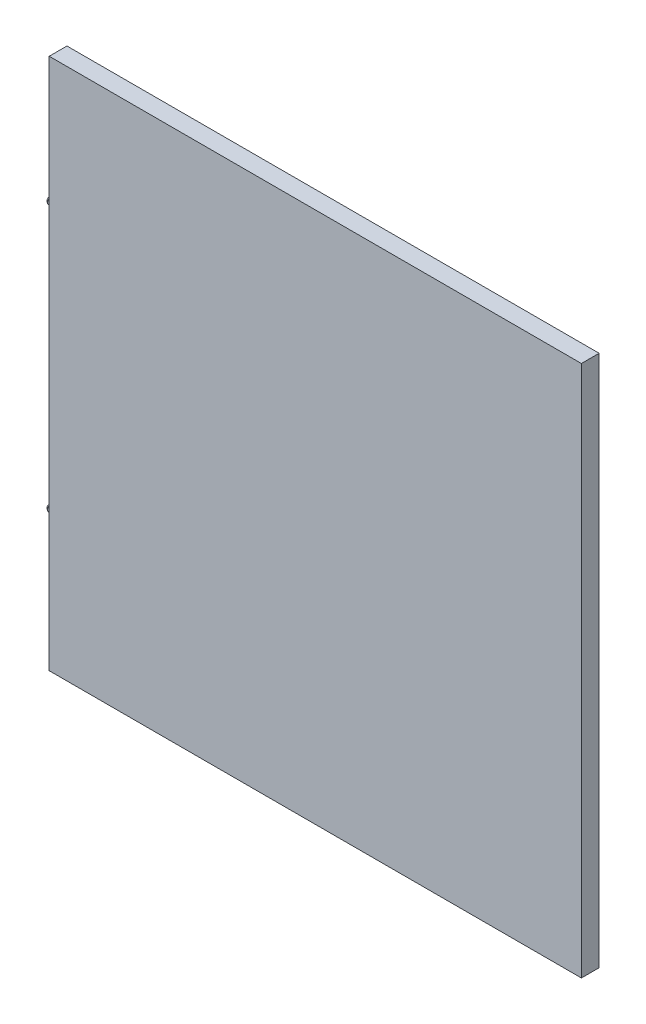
ISO-10303-21;
HEADER;
FILE_DESCRIPTION(('STEP AP214'),'2;1');
FILE_NAME('part.step','',(''),(''),'','','');
FILE_SCHEMA(('AUTOMOTIVE_DESIGN { 1 0 10303 214 1 1 1 1 }'));
ENDSEC;
DATA;
#1=APPLICATION_CONTEXT('core data for automotive mechanical design processes');
#2=APPLICATION_PROTOCOL_DEFINITION('international standard','automotive_design',2000,#1);
#3=PRODUCT_CONTEXT('',#1,'mechanical');
#4=PRODUCT('Part','Part','',(#3));
#5=PRODUCT_RELATED_PRODUCT_CATEGORY('part','',(#4));
#6=PRODUCT_DEFINITION_FORMATION('','',#4);
#7=PRODUCT_DEFINITION_CONTEXT('part definition',#1,'design');
#8=PRODUCT_DEFINITION('design','',#6,#7);
#9=PRODUCT_DEFINITION_SHAPE('','',#8);
#10=(LENGTH_UNIT() NAMED_UNIT(*) SI_UNIT(.MILLI.,.METRE.));
#11=(NAMED_UNIT(*) PLANE_ANGLE_UNIT() SI_UNIT($,.RADIAN.));
#12=(NAMED_UNIT(*) SI_UNIT($,.STERADIAN.) SOLID_ANGLE_UNIT());
#13=UNCERTAINTY_MEASURE_WITH_UNIT(LENGTH_MEASURE(1.E-05),#10,'distance_accuracy_value','');
#14=(GEOMETRIC_REPRESENTATION_CONTEXT(3) GLOBAL_UNCERTAINTY_ASSIGNED_CONTEXT((#13)) GLOBAL_UNIT_ASSIGNED_CONTEXT((#10,
#11,#12)) REPRESENTATION_CONTEXT('',''));
#15=CARTESIAN_POINT('',(0.,0.,0.));
#16=DIRECTION('',(0.,0.,1.));
#17=DIRECTION('',(1.,0.,0.));
#18=AXIS2_PLACEMENT_3D('',#15,#16,#17);
#19=CARTESIAN_POINT('',(-150.,-150.,10.));
#20=DIRECTION('',(1.,0.,0.));
#21=DIRECTION('',(0.,0.,-1.));
#22=AXIS2_PLACEMENT_3D('',#19,#20,#21);
#23=PLANE('',#22);
#24=CARTESIAN_POINT('',(-150.,75.,5.00000000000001));
#25=DIRECTION('',(1.,0.,0.));
#26=DIRECTION('',(0.,0.,-1.));
#27=AXIS2_PLACEMENT_3D('',#24,#25,#26);
#28=CIRCLE('',#27,2.);
#29=CARTESIAN_POINT('',(-150.,75.,3.00000000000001));
#30=VERTEX_POINT('',#29);
#31=EDGE_CURVE('E108',#30,#30,#28,.F.);
#32=ORIENTED_EDGE('',*,*,#31,.F.);
#33=EDGE_LOOP('',(#32));
#34=FACE_BOUND('',#33,.T.);
#35=DIRECTION('',(0.,-1.,0.));
#36=VECTOR('',#35,1.);
#37=CARTESIAN_POINT('',(-150.,-150.,0.));
#38=LINE('',#37,#36);
#39=CARTESIAN_POINT('',(-150.,150.,0.));
#40=VERTEX_POINT('',#39);
#41=CARTESIAN_POINT('',(-150.,-150.,0.));
#42=VERTEX_POINT('',#41);
#43=EDGE_CURVE('E64',#40,#42,#38,.T.);
#44=ORIENTED_EDGE('',*,*,#43,.T.);
#45=DIRECTION('',(0.,0.,-1.));
#46=VECTOR('',#45,1.);
#47=CARTESIAN_POINT('',(-150.,-150.,10.));
#48=LINE('',#47,#46);
#49=CARTESIAN_POINT('',(-150.,-150.,10.));
#50=VERTEX_POINT('',#49);
#51=EDGE_CURVE('E90',#50,#42,#48,.T.);
#52=ORIENTED_EDGE('',*,*,#51,.F.);
#53=DIRECTION('',(0.,-1.,0.));
#54=VECTOR('',#53,1.);
#55=CARTESIAN_POINT('',(-150.,-150.,10.));
#56=LINE('',#55,#54);
#57=CARTESIAN_POINT('',(-150.,150.,10.));
#58=VERTEX_POINT('',#57);
#59=EDGE_CURVE('E81',#58,#50,#56,.T.);
#60=ORIENTED_EDGE('',*,*,#59,.F.);
#61=DIRECTION('',(0.,0.,-1.));
#62=VECTOR('',#61,1.);
#63=CARTESIAN_POINT('',(-150.,150.,10.));
#64=LINE('',#63,#62);
#65=EDGE_CURVE('E86',#58,#40,#64,.T.);
#66=ORIENTED_EDGE('',*,*,#65,.T.);
#67=EDGE_LOOP('',(#44,#52,#60,#66));
#68=FACE_BOUND('',#67,.T.);
#69=CARTESIAN_POINT('',(-150.,-75.,5.00000000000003));
#70=DIRECTION('',(1.,0.,0.));
#71=DIRECTION('',(0.,0.,-1.));
#72=AXIS2_PLACEMENT_3D('',#69,#70,#71);
#73=CIRCLE('',#72,2.);
#74=CARTESIAN_POINT('',(-150.,-75.,3.00000000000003));
#75=VERTEX_POINT('',#74);
#76=EDGE_CURVE('E111',#75,#75,#73,.F.);
#77=ORIENTED_EDGE('',*,*,#76,.F.);
#78=EDGE_LOOP('',(#77));
#79=FACE_BOUND('',#78,.T.);
#80=ADVANCED_FACE('F30',(#34,#68,#79),#23,.F.);
#81=CARTESIAN_POINT('',(150.,-150.,10.));
#82=DIRECTION('',(-1.,0.,0.));
#83=DIRECTION('',(0.,0.,1.));
#84=AXIS2_PLACEMENT_3D('',#81,#82,#83);
#85=PLANE('',#84);
#86=DIRECTION('',(0.,1.,0.));
#87=VECTOR('',#86,1.);
#88=CARTESIAN_POINT('',(150.,-150.,0.));
#89=LINE('',#88,#87);
#90=CARTESIAN_POINT('',(150.,-150.,0.));
#91=VERTEX_POINT('',#90);
#92=CARTESIAN_POINT('',(150.,150.,0.));
#93=VERTEX_POINT('',#92);
#94=EDGE_CURVE('E98',#91,#93,#89,.T.);
#95=ORIENTED_EDGE('',*,*,#94,.T.);
#96=DIRECTION('',(0.,0.,-1.));
#97=VECTOR('',#96,1.);
#98=CARTESIAN_POINT('',(150.,150.,10.));
#99=LINE('',#98,#97);
#100=CARTESIAN_POINT('',(150.,150.,10.));
#101=VERTEX_POINT('',#100);
#102=EDGE_CURVE('E89',#101,#93,#99,.T.);
#103=ORIENTED_EDGE('',*,*,#102,.F.);
#104=DIRECTION('',(0.,1.,0.));
#105=VECTOR('',#104,1.);
#106=CARTESIAN_POINT('',(150.,-150.,10.));
#107=LINE('',#106,#105);
#108=CARTESIAN_POINT('',(150.,-150.,10.));
#109=VERTEX_POINT('',#108);
#110=EDGE_CURVE('E83',#109,#101,#107,.T.);
#111=ORIENTED_EDGE('',*,*,#110,.F.);
#112=DIRECTION('',(0.,0.,-1.));
#113=VECTOR('',#112,1.);
#114=CARTESIAN_POINT('',(150.,-150.,10.));
#115=LINE('',#114,#113);
#116=EDGE_CURVE('E94',#109,#91,#115,.T.);
#117=ORIENTED_EDGE('',*,*,#116,.T.);
#118=EDGE_LOOP('',(#95,#103,#111,#117));
#119=FACE_BOUND('',#118,.T.);
#120=ADVANCED_FACE('F134',(#119),#85,.F.);
#121=CARTESIAN_POINT('',(-150.,150.,10.));
#122=DIRECTION('',(0.,-1.,0.));
#123=DIRECTION('',(0.,0.,-1.));
#124=AXIS2_PLACEMENT_3D('',#121,#122,#123);
#125=PLANE('',#124);
#126=DIRECTION('',(-1.,0.,0.));
#127=VECTOR('',#126,1.);
#128=CARTESIAN_POINT('',(-150.,150.,0.));
#129=LINE('',#128,#127);
#130=EDGE_CURVE('E88',#93,#40,#129,.T.);
#131=ORIENTED_EDGE('',*,*,#130,.T.);
#132=ORIENTED_EDGE('',*,*,#65,.F.);
#133=DIRECTION('',(-1.,0.,0.));
#134=VECTOR('',#133,1.);
#135=CARTESIAN_POINT('',(-150.,150.,10.));
#136=LINE('',#135,#134);
#137=EDGE_CURVE('E78',#101,#58,#136,.T.);
#138=ORIENTED_EDGE('',*,*,#137,.F.);
#139=ORIENTED_EDGE('',*,*,#102,.T.);
#140=EDGE_LOOP('',(#131,#132,#138,#139));
#141=FACE_BOUND('',#140,.T.);
#142=ADVANCED_FACE('F87',(#141),#125,.F.);
#143=CARTESIAN_POINT('',(-150.,-150.,10.));
#144=DIRECTION('',(0.,1.,0.));
#145=DIRECTION('',(0.,0.,1.));
#146=AXIS2_PLACEMENT_3D('',#143,#144,#145);
#147=PLANE('',#146);
#148=DIRECTION('',(1.,0.,0.));
#149=VECTOR('',#148,1.);
#150=CARTESIAN_POINT('',(-150.,-150.,0.));
#151=LINE('',#150,#149);
#152=EDGE_CURVE('E70',#42,#91,#151,.T.);
#153=ORIENTED_EDGE('',*,*,#152,.T.);
#154=ORIENTED_EDGE('',*,*,#116,.F.);
#155=DIRECTION('',(1.,0.,0.));
#156=VECTOR('',#155,1.);
#157=CARTESIAN_POINT('',(-150.,-150.,10.));
#158=LINE('',#157,#156);
#159=EDGE_CURVE('E47',#50,#109,#158,.T.);
#160=ORIENTED_EDGE('',*,*,#159,.F.);
#161=ORIENTED_EDGE('',*,*,#51,.T.);
#162=EDGE_LOOP('',(#153,#154,#160,#161));
#163=FACE_BOUND('',#162,.T.);
#164=ADVANCED_FACE('F145',(#163),#147,.F.);
#165=CARTESIAN_POINT('',(150.,150.,10.));
#166=DIRECTION('',(0.,0.,-1.));
#167=DIRECTION('',(-1.,0.,0.));
#168=AXIS2_PLACEMENT_3D('',#165,#166,#167);
#169=PLANE('',#168);
#170=ORIENTED_EDGE('',*,*,#110,.T.);
#171=ORIENTED_EDGE('',*,*,#137,.T.);
#172=ORIENTED_EDGE('',*,*,#59,.T.);
#173=ORIENTED_EDGE('',*,*,#159,.T.);
#174=EDGE_LOOP('',(#170,#171,#172,#173));
#175=FACE_BOUND('',#174,.T.);
#176=ADVANCED_FACE('F79',(#175),#169,.F.);
#177=CARTESIAN_POINT('',(150.,150.,0.));
#178=DIRECTION('',(0.,0.,-1.));
#179=DIRECTION('',(-1.,0.,0.));
#180=AXIS2_PLACEMENT_3D('',#177,#178,#179);
#181=PLANE('',#180);
#182=CARTESIAN_POINT('',(144.,-75.,0.));
#183=DIRECTION('',(0.,0.,-1.));
#184=DIRECTION('',(1.,0.,0.));
#185=AXIS2_PLACEMENT_3D('',#182,#183,#184);
#186=CIRCLE('',#185,2.);
#187=CARTESIAN_POINT('',(146.,-75.,0.));
#188=VERTEX_POINT('',#187);
#189=EDGE_CURVE('E285',#188,#188,#186,.T.);
#190=ORIENTED_EDGE('',*,*,#189,.F.);
#191=EDGE_LOOP('',(#190));
#192=FACE_BOUND('',#191,.T.);
#193=CARTESIAN_POINT('',(144.,75.,0.));
#194=DIRECTION('',(0.,0.,-1.));
#195=DIRECTION('',(-1.,0.,0.));
#196=AXIS2_PLACEMENT_3D('',#193,#194,#195);
#197=CIRCLE('',#196,2.);
#198=CARTESIAN_POINT('',(142.,75.,0.));
#199=VERTEX_POINT('',#198);
#200=EDGE_CURVE('E284',#199,#199,#197,.T.);
#201=ORIENTED_EDGE('',*,*,#200,.F.);
#202=EDGE_LOOP('',(#201));
#203=FACE_BOUND('',#202,.T.);
#204=ORIENTED_EDGE('',*,*,#94,.F.);
#205=ORIENTED_EDGE('',*,*,#152,.F.);
#206=ORIENTED_EDGE('',*,*,#43,.F.);
#207=ORIENTED_EDGE('',*,*,#130,.F.);
#208=EDGE_LOOP('',(#204,#205,#206,#207));
#209=FACE_BOUND('',#208,.T.);
#210=ADVANCED_FACE('F154',(#192,#203,#209),#181,.T.);
#211=CARTESIAN_POINT('',(144.,75.,5.));
#212=DIRECTION('',(0.,0.,-1.));
#213=DIRECTION('',(-1.,0.,0.));
#214=AXIS2_PLACEMENT_3D('',#211,#212,#213);
#215=CYLINDRICAL_SURFACE('',#214,2.);
#216=CARTESIAN_POINT('',(144.,75.,5.));
#217=DIRECTION('',(0.,0.,-1.));
#218=DIRECTION('',(-1.,0.,0.));
#219=AXIS2_PLACEMENT_3D('',#216,#217,#218);
#220=CIRCLE('',#219,2.);
#221=CARTESIAN_POINT('',(142.,75.,5.));
#222=VERTEX_POINT('',#221);
#223=EDGE_CURVE('E101',#222,#222,#220,.T.);
#224=ORIENTED_EDGE('',*,*,#223,.F.);
#225=EDGE_LOOP('',(#224));
#226=FACE_BOUND('',#225,.T.);
#227=ORIENTED_EDGE('',*,*,#200,.T.);
#228=EDGE_LOOP('',(#227));
#229=FACE_BOUND('',#228,.T.);
#230=ADVANCED_FACE('F159',(#226,#229),#215,.F.);
#231=CARTESIAN_POINT('',(144.,75.,5.));
#232=DIRECTION('',(0.,0.,-1.));
#233=DIRECTION('',(-1.,0.,0.));
#234=AXIS2_PLACEMENT_3D('',#231,#232,#233);
#235=PLANE('',#234);
#236=ORIENTED_EDGE('',*,*,#223,.T.);
#237=EDGE_LOOP('',(#236));
#238=FACE_BOUND('',#237,.T.);
#239=ADVANCED_FACE('F164',(#238),#235,.T.);
#240=CARTESIAN_POINT('',(144.,-75.,5.));
#241=DIRECTION('',(0.,0.,-1.));
#242=DIRECTION('',(-1.,0.,0.));
#243=AXIS2_PLACEMENT_3D('',#240,#241,#242);
#244=CYLINDRICAL_SURFACE('',#243,2.);
#245=CARTESIAN_POINT('',(144.,-75.,5.));
#246=DIRECTION('',(0.,0.,-1.));
#247=DIRECTION('',(1.,0.,0.));
#248=AXIS2_PLACEMENT_3D('',#245,#246,#247);
#249=CIRCLE('',#248,2.);
#250=CARTESIAN_POINT('',(146.,-75.,5.));
#251=VERTEX_POINT('',#250);
#252=EDGE_CURVE('E283',#251,#251,#249,.T.);
#253=ORIENTED_EDGE('',*,*,#252,.F.);
#254=EDGE_LOOP('',(#253));
#255=FACE_BOUND('',#254,.T.);
#256=ORIENTED_EDGE('',*,*,#189,.T.);
#257=EDGE_LOOP('',(#256));
#258=FACE_BOUND('',#257,.T.);
#259=ADVANCED_FACE('F168',(#255,#258),#244,.F.);
#260=CARTESIAN_POINT('',(144.,-75.,5.));
#261=DIRECTION('',(0.,0.,1.));
#262=DIRECTION('',(1.,0.,0.));
#263=AXIS2_PLACEMENT_3D('',#260,#261,#262);
#264=PLANE('',#263);
#265=ORIENTED_EDGE('',*,*,#252,.T.);
#266=EDGE_LOOP('',(#265));
#267=FACE_BOUND('',#266,.T.);
#268=ADVANCED_FACE('F172',(#267),#264,.F.);
#269=CARTESIAN_POINT('',(-150.,75.,5.00000000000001));
#270=DIRECTION('',(1.,0.,0.));
#271=DIRECTION('',(0.,0.,1.));
#272=AXIS2_PLACEMENT_3D('',#269,#270,#271);
#273=CONICAL_SURFACE('',#272,2.,0.0174532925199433);
#274=CARTESIAN_POINT('',(-154.000152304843,75.,5.00000000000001));
#275=DIRECTION('',(1.,0.,0.));
#276=DIRECTION('',(0.,0.,-1.));
#277=AXIS2_PLACEMENT_3D('',#274,#275,#276);
#278=CIRCLE('',#277,1.9301770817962);
#279=CARTESIAN_POINT('',(-154.000152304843,75.,3.06982291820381));
#280=VERTEX_POINT('',#279);
#281=EDGE_CURVE('E11',#280,#280,#278,.T.);
#282=ORIENTED_EDGE('',*,*,#281,.T.);
#283=EDGE_LOOP('',(#282));
#284=FACE_BOUND('',#283,.T.);
#285=ORIENTED_EDGE('',*,*,#31,.T.);
#286=EDGE_LOOP('',(#285));
#287=FACE_BOUND('',#286,.T.);
#288=ADVANCED_FACE('F176',(#284,#287),#273,.T.);
#289=CARTESIAN_POINT('',(-155.,75.,5.00000000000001));
#290=DIRECTION('',(-1.,0.,0.));
#291=DIRECTION('',(0.,0.,1.));
#292=AXIS2_PLACEMENT_3D('',#289,#290,#291);
#293=PLANE('',#292);
#294=CARTESIAN_POINT('',(-155.,75.,5.00000000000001));
#295=DIRECTION('',(-1.,0.,0.));
#296=DIRECTION('',(0.,0.,1.));
#297=AXIS2_PLACEMENT_3D('',#294,#295,#296);
#298=CIRCLE('',#297,1.32940797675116);
#299=CARTESIAN_POINT('',(-155.,75.,6.32940797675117));
#300=VERTEX_POINT('',#299);
#301=EDGE_CURVE('E39',#300,#300,#298,.T.);
#302=ORIENTED_EDGE('',*,*,#301,.T.);
#303=EDGE_LOOP('',(#302));
#304=FACE_BOUND('',#303,.T.);
#305=ADVANCED_FACE('F122',(#304),#293,.T.);
#306=CARTESIAN_POINT('',(-150.,-75.,5.00000000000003));
#307=DIRECTION('',(1.,0.,0.));
#308=DIRECTION('',(0.,0.,-1.));
#309=AXIS2_PLACEMENT_3D('',#306,#307,#308);
#310=CONICAL_SURFACE('',#309,2.,0.0174532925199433);
#311=CARTESIAN_POINT('',(-154.000152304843,-75.,5.00000000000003));
#312=DIRECTION('',(-1.,0.,0.));
#313=DIRECTION('',(0.,0.,1.));
#314=AXIS2_PLACEMENT_3D('',#311,#312,#313);
#315=CIRCLE('',#314,1.9301770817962);
#316=CARTESIAN_POINT('',(-154.000152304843,-75.,6.93017708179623));
#317=VERTEX_POINT('',#316);
#318=EDGE_CURVE('E117',#317,#317,#315,.F.);
#319=ORIENTED_EDGE('',*,*,#318,.T.);
#320=EDGE_LOOP('',(#319));
#321=FACE_BOUND('',#320,.T.);
#322=ORIENTED_EDGE('',*,*,#76,.T.);
#323=EDGE_LOOP('',(#322));
#324=FACE_BOUND('',#323,.T.);
#325=ADVANCED_FACE('F183',(#321,#324),#310,.T.);
#326=CARTESIAN_POINT('',(-155.,-75.,5.00000000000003));
#327=DIRECTION('',(1.,0.,0.));
#328=DIRECTION('',(0.,0.,-1.));
#329=AXIS2_PLACEMENT_3D('',#326,#327,#328);
#330=PLANE('',#329);
#331=CARTESIAN_POINT('',(-155.,-75.,5.00000000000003));
#332=DIRECTION('',(1.,0.,0.));
#333=DIRECTION('',(0.,0.,-1.));
#334=AXIS2_PLACEMENT_3D('',#331,#332,#333);
#335=CIRCLE('',#334,1.32940797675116);
#336=CARTESIAN_POINT('',(-155.,-75.,3.67059202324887));
#337=VERTEX_POINT('',#336);
#338=EDGE_CURVE('E114',#337,#337,#335,.F.);
#339=ORIENTED_EDGE('',*,*,#338,.T.);
#340=EDGE_LOOP('',(#339));
#341=FACE_BOUND('',#340,.T.);
#342=ADVANCED_FACE('F130',(#341),#330,.F.);
#343=CARTESIAN_POINT('',(-155.,-75.,5.00000000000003));
#344=DIRECTION('',(1.,0.,0.));
#345=DIRECTION('',(0.,0.,-1.));
#346=AXIS2_PLACEMENT_3D('',#343,#344,#345);
#347=CONICAL_SURFACE('',#346,1.32940797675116,0.541052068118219);
#348=ORIENTED_EDGE('',*,*,#318,.F.);
#349=EDGE_LOOP('',(#348));
#350=FACE_BOUND('',#349,.T.);
#351=ORIENTED_EDGE('',*,*,#338,.F.);
#352=EDGE_LOOP('',(#351));
#353=FACE_BOUND('',#352,.T.);
#354=ADVANCED_FACE('F125',(#350,#353),#347,.T.);
#355=CARTESIAN_POINT('',(-155.,75.,5.00000000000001));
#356=DIRECTION('',(1.,0.,0.));
#357=DIRECTION('',(0.,0.,-1.));
#358=AXIS2_PLACEMENT_3D('',#355,#356,#357);
#359=CONICAL_SURFACE('',#358,1.32940797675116,0.541052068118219);
#360=ORIENTED_EDGE('',*,*,#281,.F.);
#361=EDGE_LOOP('',(#360));
#362=FACE_BOUND('',#361,.T.);
#363=ORIENTED_EDGE('',*,*,#301,.F.);
#364=EDGE_LOOP('',(#363));
#365=FACE_BOUND('',#364,.T.);
#366=ADVANCED_FACE('F32',(#362,#365),#359,.T.);
#367=CLOSED_SHELL('',(#80,#120,#142,#164,#176,#210,#230,#239,#259,#268,#288,#305,#325,#342,#354,#366));
#368=MANIFOLD_SOLID_BREP('B2',#367);
#369=ADVANCED_BREP_SHAPE_REPRESENTATION('',(#18,#368),#14);
#370=SHAPE_DEFINITION_REPRESENTATION(#9,#369);
ENDSEC;
END-ISO-10303-21;
